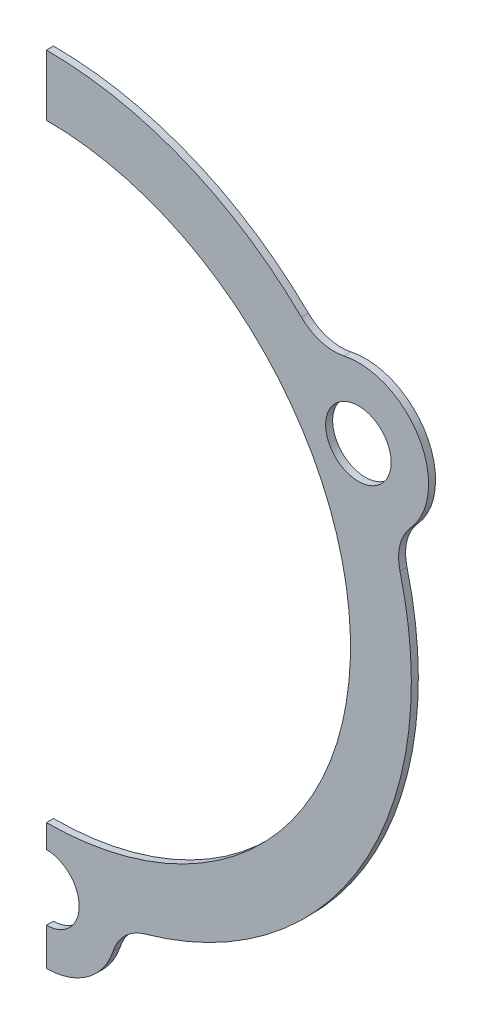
ISO-10303-21;
HEADER;
FILE_DESCRIPTION(('STEP AP214'),'2;1');
FILE_NAME('part.step','',(''),(''),'','','');
FILE_SCHEMA(('AUTOMOTIVE_DESIGN { 1 0 10303 214 1 1 1 1 }'));
ENDSEC;
DATA;
#1=APPLICATION_CONTEXT('core data for automotive mechanical design processes');
#2=APPLICATION_PROTOCOL_DEFINITION('international standard','automotive_design',2000,#1);
#3=PRODUCT_CONTEXT('',#1,'mechanical');
#4=PRODUCT('Part','Part','',(#3));
#5=PRODUCT_RELATED_PRODUCT_CATEGORY('part','',(#4));
#6=PRODUCT_DEFINITION_FORMATION('','',#4);
#7=PRODUCT_DEFINITION_CONTEXT('part definition',#1,'design');
#8=PRODUCT_DEFINITION('design','',#6,#7);
#9=PRODUCT_DEFINITION_SHAPE('','',#8);
#10=(LENGTH_UNIT() NAMED_UNIT(*) SI_UNIT(.MILLI.,.METRE.));
#11=(NAMED_UNIT(*) PLANE_ANGLE_UNIT() SI_UNIT($,.RADIAN.));
#12=(NAMED_UNIT(*) SI_UNIT($,.STERADIAN.) SOLID_ANGLE_UNIT());
#13=UNCERTAINTY_MEASURE_WITH_UNIT(LENGTH_MEASURE(1.E-05),#10,'distance_accuracy_value','');
#14=(GEOMETRIC_REPRESENTATION_CONTEXT(3) GLOBAL_UNCERTAINTY_ASSIGNED_CONTEXT((#13)) GLOBAL_UNIT_ASSIGNED_CONTEXT((#10,
#11,#12)) REPRESENTATION_CONTEXT('',''));
#15=CARTESIAN_POINT('',(0.,0.,0.));
#16=DIRECTION('',(0.,0.,1.));
#17=DIRECTION('',(1.,0.,0.));
#18=AXIS2_PLACEMENT_3D('',#15,#16,#17);
#19=CARTESIAN_POINT('',(11.8879062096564,-80.8636363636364,1.5));
#20=DIRECTION('',(0.,0.,1.));
#21=DIRECTION('',(1.,0.,0.));
#22=AXIS2_PLACEMENT_3D('',#19,#20,#21);
#23=PLANE('',#22);
#24=DIRECTION('',(0.,1.,0.));
#25=VECTOR('',#24,1.);
#26=CARTESIAN_POINT('',(0.,80.,1.5));
#27=LINE('',#26,#25);
#28=CARTESIAN_POINT('',(0.,-92.,1.5));
#29=VERTEX_POINT('',#28);
#30=CARTESIAN_POINT('',(0.,-84.,1.5));
#31=VERTEX_POINT('',#30);
#32=EDGE_CURVE('E47',#29,#31,#27,.T.);
#33=ORIENTED_EDGE('',*,*,#32,.F.);
#34=CARTESIAN_POINT('',(0.,-77.,1.5));
#35=DIRECTION('',(0.,0.,1.));
#36=DIRECTION('',(1.,0.,0.));
#37=AXIS2_PLACEMENT_3D('',#34,#35,#36);
#38=CIRCLE('',#37,15.);
#39=CARTESIAN_POINT('',(14.2654874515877,-81.6363636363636,1.5));
#40=VERTEX_POINT('',#39);
#41=EDGE_CURVE('E125',#29,#40,#38,.T.);
#42=ORIENTED_EDGE('',*,*,#41,.T.);
#43=CARTESIAN_POINT('',(23.7758124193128,-84.7272727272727,1.5));
#44=DIRECTION('',(0.,0.,-1.));
#45=DIRECTION('',(1.,0.,0.));
#46=AXIS2_PLACEMENT_3D('',#43,#44,#45);
#47=CIRCLE('',#46,10.);
#48=CARTESIAN_POINT('',(21.0740155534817,-75.099173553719,1.5));
#49=VERTEX_POINT('',#48);
#50=EDGE_CURVE('E187',#40,#49,#47,.T.);
#51=ORIENTED_EDGE('',*,*,#50,.T.);
#52=CARTESIAN_POINT('',(0.,0.,1.5));
#53=DIRECTION('',(0.,0.,1.));
#54=DIRECTION('',(1.,0.,0.));
#55=AXIS2_PLACEMENT_3D('',#52,#53,#54);
#56=CIRCLE('',#55,78.);
#57=CARTESIAN_POINT('',(75.5747998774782,19.2989539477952,1.5));
#58=VERTEX_POINT('',#57);
#59=EDGE_CURVE('E194',#49,#58,#56,.T.);
#60=ORIENTED_EDGE('',*,*,#59,.T.);
#61=CARTESIAN_POINT('',(85.2638767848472,21.7731788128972,1.5));
#62=DIRECTION('',(0.,0.,-1.));
#63=DIRECTION('',(-1.,0.,0.));
#64=AXIS2_PLACEMENT_3D('',#61,#62,#63);
#65=CIRCLE('',#64,10.);
#66=CARTESIAN_POINT('',(77.8319085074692,28.463907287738,1.5));
#67=VERTEX_POINT('',#66);
#68=EDGE_CURVE('E196',#58,#67,#65,.T.);
#69=ORIENTED_EDGE('',*,*,#68,.T.);
#70=CARTESIAN_POINT('',(66.6839560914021,38.4999999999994,1.5));
#71=DIRECTION('',(0.,0.,1.));
#72=DIRECTION('',(1.,0.,0.));
#73=AXIS2_PLACEMENT_3D('',#70,#71,#72);
#74=CIRCLE('',#73,15.);
#75=CARTESIAN_POINT('',(63.5664210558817,53.1724563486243,1.5));
#76=VERTEX_POINT('',#75);
#77=EDGE_CURVE('E198',#67,#76,#74,.T.);
#78=ORIENTED_EDGE('',*,*,#77,.T.);
#79=CARTESIAN_POINT('',(61.4880643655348,62.9540939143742,1.5));
#80=DIRECTION('',(0.,0.,-1.));
#81=DIRECTION('',(1.,0.,0.));
#82=AXIS2_PLACEMENT_3D('',#79,#80,#81);
#83=CIRCLE('',#82,10.);
#84=CARTESIAN_POINT('',(54.5007843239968,55.8002196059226,1.5));
#85=VERTEX_POINT('',#84);
#86=EDGE_CURVE('E142',#76,#85,#83,.T.);
#87=ORIENTED_EDGE('',*,*,#86,.T.);
#88=CARTESIAN_POINT('',(0.,0.,1.5));
#89=DIRECTION('',(0.,0.,1.));
#90=DIRECTION('',(1.,0.,0.));
#91=AXIS2_PLACEMENT_3D('',#88,#89,#90);
#92=CIRCLE('',#91,78.);
#93=CARTESIAN_POINT('',(0.,78.,1.5));
#94=VERTEX_POINT('',#93);
#95=EDGE_CURVE('E137',#85,#94,#92,.T.);
#96=ORIENTED_EDGE('',*,*,#95,.T.);
#97=CARTESIAN_POINT('',(0.,65.,1.5));
#98=VERTEX_POINT('',#97);
#99=EDGE_CURVE('E132',#98,#94,#27,.T.);
#100=ORIENTED_EDGE('',*,*,#99,.F.);
#101=CARTESIAN_POINT('',(0.,0.,1.5));
#102=DIRECTION('',(0.,0.,1.));
#103=DIRECTION('',(1.,0.,0.));
#104=AXIS2_PLACEMENT_3D('',#101,#102,#103);
#105=CIRCLE('',#104,65.);
#106=CARTESIAN_POINT('',(0.,-65.,1.5));
#107=VERTEX_POINT('',#106);
#108=EDGE_CURVE('E216',#107,#98,#105,.T.);
#109=ORIENTED_EDGE('',*,*,#108,.F.);
#110=CARTESIAN_POINT('',(0.,-70.,1.5));
#111=VERTEX_POINT('',#110);
#112=EDGE_CURVE('E130',#111,#107,#27,.T.);
#113=ORIENTED_EDGE('',*,*,#112,.F.);
#114=CARTESIAN_POINT('',(0.,-77.,1.5));
#115=DIRECTION('',(0.,0.,1.));
#116=DIRECTION('',(1.,0.,0.));
#117=AXIS2_PLACEMENT_3D('',#114,#115,#116);
#118=CIRCLE('',#117,7.);
#119=EDGE_CURVE('E129',#31,#111,#118,.T.);
#120=ORIENTED_EDGE('',*,*,#119,.F.);
#121=EDGE_LOOP('',(#33,#42,#51,#60,#69,#78,#87,#96,#100,#109,#113,#120));
#122=FACE_BOUND('',#121,.T.);
#123=CARTESIAN_POINT('',(66.6839560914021,38.4999999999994,1.5));
#124=DIRECTION('',(0.,0.,1.));
#125=DIRECTION('',(-0.499999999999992,0.866025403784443,0.));
#126=AXIS2_PLACEMENT_3D('',#123,#124,#125);
#127=CIRCLE('',#126,7.);
#128=CARTESIAN_POINT('',(63.1839560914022,44.5621778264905,1.5));
#129=VERTEX_POINT('',#128);
#130=EDGE_CURVE('E225',#129,#129,#127,.T.);
#131=ORIENTED_EDGE('',*,*,#130,.F.);
#132=EDGE_LOOP('',(#131));
#133=FACE_BOUND('',#132,.T.);
#134=ADVANCED_FACE('F24',(#122,#133),#23,.T.);
#135=CARTESIAN_POINT('',(11.8879062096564,-80.8636363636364,0.));
#136=DIRECTION('',(0.,0.,1.));
#137=DIRECTION('',(1.,0.,0.));
#138=AXIS2_PLACEMENT_3D('',#135,#136,#137);
#139=PLANE('',#138);
#140=CARTESIAN_POINT('',(66.6839560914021,38.4999999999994,0.));
#141=DIRECTION('',(0.,0.,1.));
#142=DIRECTION('',(-0.499999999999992,0.866025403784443,0.));
#143=AXIS2_PLACEMENT_3D('',#140,#141,#142);
#144=CIRCLE('',#143,7.);
#145=CARTESIAN_POINT('',(63.1839560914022,44.5621778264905,0.));
#146=VERTEX_POINT('',#145);
#147=EDGE_CURVE('E222',#146,#146,#144,.T.);
#148=ORIENTED_EDGE('',*,*,#147,.T.);
#149=EDGE_LOOP('',(#148));
#150=FACE_BOUND('',#149,.T.);
#151=CARTESIAN_POINT('',(0.,-77.,0.));
#152=DIRECTION('',(0.,0.,1.));
#153=DIRECTION('',(1.,0.,0.));
#154=AXIS2_PLACEMENT_3D('',#151,#152,#153);
#155=CIRCLE('',#154,15.);
#156=CARTESIAN_POINT('',(0.,-92.,0.));
#157=VERTEX_POINT('',#156);
#158=CARTESIAN_POINT('',(14.2654874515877,-81.6363636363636,0.));
#159=VERTEX_POINT('',#158);
#160=EDGE_CURVE('E168',#157,#159,#155,.T.);
#161=ORIENTED_EDGE('',*,*,#160,.F.);
#162=DIRECTION('',(0.,1.,0.));
#163=VECTOR('',#162,1.);
#164=CARTESIAN_POINT('',(0.,80.,0.));
#165=LINE('',#164,#163);
#166=CARTESIAN_POINT('',(0.,-84.,0.));
#167=VERTEX_POINT('',#166);
#168=EDGE_CURVE('E114',#157,#167,#165,.T.);
#169=ORIENTED_EDGE('',*,*,#168,.T.);
#170=CARTESIAN_POINT('',(0.,-77.,0.));
#171=DIRECTION('',(0.,0.,1.));
#172=DIRECTION('',(1.,0.,0.));
#173=AXIS2_PLACEMENT_3D('',#170,#171,#172);
#174=CIRCLE('',#173,7.);
#175=CARTESIAN_POINT('',(0.,-70.,0.));
#176=VERTEX_POINT('',#175);
#177=EDGE_CURVE('E163',#167,#176,#174,.T.);
#178=ORIENTED_EDGE('',*,*,#177,.T.);
#179=CARTESIAN_POINT('',(0.,-65.,0.));
#180=VERTEX_POINT('',#179);
#181=EDGE_CURVE('E170',#176,#180,#165,.T.);
#182=ORIENTED_EDGE('',*,*,#181,.T.);
#183=CARTESIAN_POINT('',(0.,0.,0.));
#184=DIRECTION('',(0.,0.,1.));
#185=DIRECTION('',(1.,0.,0.));
#186=AXIS2_PLACEMENT_3D('',#183,#184,#185);
#187=CIRCLE('',#186,65.);
#188=CARTESIAN_POINT('',(0.,65.,0.));
#189=VERTEX_POINT('',#188);
#190=EDGE_CURVE('E179',#180,#189,#187,.T.);
#191=ORIENTED_EDGE('',*,*,#190,.T.);
#192=CARTESIAN_POINT('',(0.,78.,0.));
#193=VERTEX_POINT('',#192);
#194=EDGE_CURVE('E39',#189,#193,#165,.T.);
#195=ORIENTED_EDGE('',*,*,#194,.T.);
#196=CARTESIAN_POINT('',(0.,0.,0.));
#197=DIRECTION('',(0.,0.,1.));
#198=DIRECTION('',(1.,0.,0.));
#199=AXIS2_PLACEMENT_3D('',#196,#197,#198);
#200=CIRCLE('',#199,78.);
#201=CARTESIAN_POINT('',(54.5007843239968,55.8002196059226,0.));
#202=VERTEX_POINT('',#201);
#203=EDGE_CURVE('E177',#202,#193,#200,.T.);
#204=ORIENTED_EDGE('',*,*,#203,.F.);
#205=CARTESIAN_POINT('',(61.4880643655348,62.9540939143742,0.));
#206=DIRECTION('',(0.,0.,-1.));
#207=DIRECTION('',(1.,0.,0.));
#208=AXIS2_PLACEMENT_3D('',#205,#206,#207);
#209=CIRCLE('',#208,10.);
#210=CARTESIAN_POINT('',(63.5664210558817,53.1724563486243,0.));
#211=VERTEX_POINT('',#210);
#212=EDGE_CURVE('E185',#211,#202,#209,.T.);
#213=ORIENTED_EDGE('',*,*,#212,.F.);
#214=CARTESIAN_POINT('',(66.6839560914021,38.4999999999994,0.));
#215=DIRECTION('',(0.,0.,1.));
#216=DIRECTION('',(1.,0.,0.));
#217=AXIS2_PLACEMENT_3D('',#214,#215,#216);
#218=CIRCLE('',#217,15.);
#219=CARTESIAN_POINT('',(77.8319085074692,28.463907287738,0.));
#220=VERTEX_POINT('',#219);
#221=EDGE_CURVE('E189',#220,#211,#218,.T.);
#222=ORIENTED_EDGE('',*,*,#221,.F.);
#223=CARTESIAN_POINT('',(85.2638767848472,21.7731788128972,0.));
#224=DIRECTION('',(0.,0.,-1.));
#225=DIRECTION('',(-1.,0.,0.));
#226=AXIS2_PLACEMENT_3D('',#223,#224,#225);
#227=CIRCLE('',#226,10.);
#228=CARTESIAN_POINT('',(75.5747998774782,19.2989539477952,0.));
#229=VERTEX_POINT('',#228);
#230=EDGE_CURVE('E207',#229,#220,#227,.T.);
#231=ORIENTED_EDGE('',*,*,#230,.F.);
#232=CARTESIAN_POINT('',(0.,0.,0.));
#233=DIRECTION('',(0.,0.,1.));
#234=DIRECTION('',(1.,0.,0.));
#235=AXIS2_PLACEMENT_3D('',#232,#233,#234);
#236=CIRCLE('',#235,78.);
#237=CARTESIAN_POINT('',(21.0740155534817,-75.099173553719,0.));
#238=VERTEX_POINT('',#237);
#239=EDGE_CURVE('E209',#238,#229,#236,.T.);
#240=ORIENTED_EDGE('',*,*,#239,.F.);
#241=CARTESIAN_POINT('',(23.7758124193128,-84.7272727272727,0.));
#242=DIRECTION('',(0.,0.,-1.));
#243=DIRECTION('',(1.,0.,0.));
#244=AXIS2_PLACEMENT_3D('',#241,#242,#243);
#245=CIRCLE('',#244,10.);
#246=EDGE_CURVE('E213',#159,#238,#245,.T.);
#247=ORIENTED_EDGE('',*,*,#246,.F.);
#248=EDGE_LOOP('',(#161,#169,#178,#182,#191,#195,#204,#213,#222,#231,#240,#247));
#249=FACE_BOUND('',#248,.T.);
#250=ADVANCED_FACE('F165',(#150,#249),#139,.F.);
#251=CARTESIAN_POINT('',(23.7758124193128,-84.7272727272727,1.5));
#252=DIRECTION('',(0.,0.,-1.));
#253=DIRECTION('',(-1.,0.,0.));
#254=AXIS2_PLACEMENT_3D('',#251,#252,#253);
#255=CYLINDRICAL_SURFACE('',#254,10.);
#256=ORIENTED_EDGE('',*,*,#246,.T.);
#257=DIRECTION('',(0.,0.,-1.));
#258=VECTOR('',#257,1.);
#259=CARTESIAN_POINT('',(21.0740155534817,-75.099173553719,1.5));
#260=LINE('',#259,#258);
#261=EDGE_CURVE('E157',#49,#238,#260,.T.);
#262=ORIENTED_EDGE('',*,*,#261,.F.);
#263=ORIENTED_EDGE('',*,*,#50,.F.);
#264=DIRECTION('',(0.,0.,-1.));
#265=VECTOR('',#264,1.);
#266=CARTESIAN_POINT('',(14.2654874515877,-81.6363636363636,1.5));
#267=LINE('',#266,#265);
#268=EDGE_CURVE('E135',#40,#159,#267,.T.);
#269=ORIENTED_EDGE('',*,*,#268,.T.);
#270=EDGE_LOOP('',(#256,#262,#263,#269));
#271=FACE_BOUND('',#270,.T.);
#272=ADVANCED_FACE('F26',(#271),#255,.F.);
#273=CARTESIAN_POINT('',(0.,0.,1.5));
#274=DIRECTION('',(0.,0.,-1.));
#275=DIRECTION('',(-1.,0.,0.));
#276=AXIS2_PLACEMENT_3D('',#273,#274,#275);
#277=CYLINDRICAL_SURFACE('',#276,78.);
#278=ORIENTED_EDGE('',*,*,#239,.T.);
#279=DIRECTION('',(0.,0.,-1.));
#280=VECTOR('',#279,1.);
#281=CARTESIAN_POINT('',(75.5747998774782,19.2989539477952,1.5));
#282=LINE('',#281,#280);
#283=EDGE_CURVE('E154',#58,#229,#282,.T.);
#284=ORIENTED_EDGE('',*,*,#283,.F.);
#285=ORIENTED_EDGE('',*,*,#59,.F.);
#286=ORIENTED_EDGE('',*,*,#261,.T.);
#287=EDGE_LOOP('',(#278,#284,#285,#286));
#288=FACE_BOUND('',#287,.T.);
#289=ADVANCED_FACE('F264',(#288),#277,.T.);
#290=CARTESIAN_POINT('',(85.2638767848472,21.7731788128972,1.5));
#291=DIRECTION('',(0.,0.,-1.));
#292=DIRECTION('',(-1.,0.,0.));
#293=AXIS2_PLACEMENT_3D('',#290,#291,#292);
#294=CYLINDRICAL_SURFACE('',#293,10.);
#295=ORIENTED_EDGE('',*,*,#230,.T.);
#296=DIRECTION('',(0.,0.,-1.));
#297=VECTOR('',#296,1.);
#298=CARTESIAN_POINT('',(77.8319085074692,28.463907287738,1.5));
#299=LINE('',#298,#297);
#300=EDGE_CURVE('E151',#67,#220,#299,.T.);
#301=ORIENTED_EDGE('',*,*,#300,.F.);
#302=ORIENTED_EDGE('',*,*,#68,.F.);
#303=ORIENTED_EDGE('',*,*,#283,.T.);
#304=EDGE_LOOP('',(#295,#301,#302,#303));
#305=FACE_BOUND('',#304,.T.);
#306=ADVANCED_FACE('F262',(#305),#294,.F.);
#307=CARTESIAN_POINT('',(66.6839560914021,38.4999999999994,1.5));
#308=DIRECTION('',(0.,0.,-1.));
#309=DIRECTION('',(-1.,0.,0.));
#310=AXIS2_PLACEMENT_3D('',#307,#308,#309);
#311=CYLINDRICAL_SURFACE('',#310,15.);
#312=ORIENTED_EDGE('',*,*,#221,.T.);
#313=DIRECTION('',(0.,0.,-1.));
#314=VECTOR('',#313,1.);
#315=CARTESIAN_POINT('',(63.5664210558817,53.1724563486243,1.5));
#316=LINE('',#315,#314);
#317=EDGE_CURVE('E148',#76,#211,#316,.T.);
#318=ORIENTED_EDGE('',*,*,#317,.F.);
#319=ORIENTED_EDGE('',*,*,#77,.F.);
#320=ORIENTED_EDGE('',*,*,#300,.T.);
#321=EDGE_LOOP('',(#312,#318,#319,#320));
#322=FACE_BOUND('',#321,.T.);
#323=ADVANCED_FACE('F259',(#322),#311,.T.);
#324=CARTESIAN_POINT('',(61.4880643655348,62.9540939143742,1.5));
#325=DIRECTION('',(0.,0.,-1.));
#326=DIRECTION('',(-1.,0.,0.));
#327=AXIS2_PLACEMENT_3D('',#324,#325,#326);
#328=CYLINDRICAL_SURFACE('',#327,10.);
#329=ORIENTED_EDGE('',*,*,#212,.T.);
#330=DIRECTION('',(0.,0.,-1.));
#331=VECTOR('',#330,1.);
#332=CARTESIAN_POINT('',(54.5007843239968,55.8002196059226,1.5));
#333=LINE('',#332,#331);
#334=EDGE_CURVE('E139',#85,#202,#333,.T.);
#335=ORIENTED_EDGE('',*,*,#334,.F.);
#336=ORIENTED_EDGE('',*,*,#86,.F.);
#337=ORIENTED_EDGE('',*,*,#317,.T.);
#338=EDGE_LOOP('',(#329,#335,#336,#337));
#339=FACE_BOUND('',#338,.T.);
#340=ADVANCED_FACE('F204',(#339),#328,.F.);
#341=CARTESIAN_POINT('',(0.,0.,1.5));
#342=DIRECTION('',(0.,0.,-1.));
#343=DIRECTION('',(-1.,0.,0.));
#344=AXIS2_PLACEMENT_3D('',#341,#342,#343);
#345=CYLINDRICAL_SURFACE('',#344,78.);
#346=ORIENTED_EDGE('',*,*,#203,.T.);
#347=DIRECTION('',(0.,0.,-1.));
#348=VECTOR('',#347,1.);
#349=CARTESIAN_POINT('',(0.,78.,1.5));
#350=LINE('',#349,#348);
#351=EDGE_CURVE('E118',#193,#94,#350,.F.);
#352=ORIENTED_EDGE('',*,*,#351,.T.);
#353=ORIENTED_EDGE('',*,*,#95,.F.);
#354=ORIENTED_EDGE('',*,*,#334,.T.);
#355=EDGE_LOOP('',(#346,#352,#353,#354));
#356=FACE_BOUND('',#355,.T.);
#357=ADVANCED_FACE('F182',(#356),#345,.T.);
#358=CARTESIAN_POINT('',(0.,-77.,1.5));
#359=DIRECTION('',(0.,0.,-1.));
#360=DIRECTION('',(-1.,0.,0.));
#361=AXIS2_PLACEMENT_3D('',#358,#359,#360);
#362=CYLINDRICAL_SURFACE('',#361,15.);
#363=ORIENTED_EDGE('',*,*,#41,.F.);
#364=DIRECTION('',(0.,0.,-1.));
#365=VECTOR('',#364,1.);
#366=CARTESIAN_POINT('',(0.,-92.,1.5));
#367=LINE('',#366,#365);
#368=EDGE_CURVE('E111',#29,#157,#367,.T.);
#369=ORIENTED_EDGE('',*,*,#368,.T.);
#370=ORIENTED_EDGE('',*,*,#160,.T.);
#371=ORIENTED_EDGE('',*,*,#268,.F.);
#372=EDGE_LOOP('',(#363,#369,#370,#371));
#373=FACE_BOUND('',#372,.T.);
#374=ADVANCED_FACE('F133',(#373),#362,.T.);
#375=CARTESIAN_POINT('',(0.,0.,1.5));
#376=DIRECTION('',(0.,0.,-1.));
#377=DIRECTION('',(-1.,0.,0.));
#378=AXIS2_PLACEMENT_3D('',#375,#376,#377);
#379=CYLINDRICAL_SURFACE('',#378,65.);
#380=DIRECTION('',(0.,0.,-1.));
#381=VECTOR('',#380,1.);
#382=CARTESIAN_POINT('',(0.,-65.,1.5));
#383=LINE('',#382,#381);
#384=EDGE_CURVE('E119',#107,#180,#383,.T.);
#385=ORIENTED_EDGE('',*,*,#384,.F.);
#386=ORIENTED_EDGE('',*,*,#108,.T.);
#387=DIRECTION('',(0.,0.,-1.));
#388=VECTOR('',#387,1.);
#389=CARTESIAN_POINT('',(0.,65.,1.5));
#390=LINE('',#389,#388);
#391=EDGE_CURVE('E169',#189,#98,#390,.F.);
#392=ORIENTED_EDGE('',*,*,#391,.F.);
#393=ORIENTED_EDGE('',*,*,#190,.F.);
#394=EDGE_LOOP('',(#385,#386,#392,#393));
#395=FACE_BOUND('',#394,.T.);
#396=ADVANCED_FACE('F234',(#395),#379,.F.);
#397=CARTESIAN_POINT('',(0.,-77.,0.));
#398=DIRECTION('',(0.,0.,1.));
#399=DIRECTION('',(1.,0.,0.));
#400=AXIS2_PLACEMENT_3D('',#397,#398,#399);
#401=CYLINDRICAL_SURFACE('',#400,7.);
#402=ORIENTED_EDGE('',*,*,#119,.T.);
#403=DIRECTION('',(0.,0.,1.));
#404=VECTOR('',#403,1.);
#405=CARTESIAN_POINT('',(0.,-70.,0.));
#406=LINE('',#405,#404);
#407=EDGE_CURVE('E11',#111,#176,#406,.F.);
#408=ORIENTED_EDGE('',*,*,#407,.T.);
#409=ORIENTED_EDGE('',*,*,#177,.F.);
#410=DIRECTION('',(0.,0.,1.));
#411=VECTOR('',#410,1.);
#412=CARTESIAN_POINT('',(0.,-84.,0.));
#413=LINE('',#412,#411);
#414=EDGE_CURVE('E32',#167,#31,#413,.T.);
#415=ORIENTED_EDGE('',*,*,#414,.T.);
#416=EDGE_LOOP('',(#402,#408,#409,#415));
#417=FACE_BOUND('',#416,.T.);
#418=ADVANCED_FACE('F161',(#417),#401,.F.);
#419=CARTESIAN_POINT('',(66.6839560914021,38.4999999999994,0.));
#420=DIRECTION('',(0.,0.,1.));
#421=DIRECTION('',(1.,0.,0.));
#422=AXIS2_PLACEMENT_3D('',#419,#420,#421);
#423=CYLINDRICAL_SURFACE('',#422,7.);
#424=ORIENTED_EDGE('',*,*,#147,.F.);
#425=EDGE_LOOP('',(#424));
#426=FACE_BOUND('',#425,.T.);
#427=ORIENTED_EDGE('',*,*,#130,.T.);
#428=EDGE_LOOP('',(#427));
#429=FACE_BOUND('',#428,.T.);
#430=ADVANCED_FACE('F243',(#426,#429),#423,.F.);
#431=CARTESIAN_POINT('',(0.,80.,0.));
#432=DIRECTION('',(1.,0.,0.));
#433=DIRECTION('',(0.,0.,-1.));
#434=AXIS2_PLACEMENT_3D('',#431,#432,#433);
#435=PLANE('',#434);
#436=ORIENTED_EDGE('',*,*,#32,.T.);
#437=ORIENTED_EDGE('',*,*,#414,.F.);
#438=ORIENTED_EDGE('',*,*,#168,.F.);
#439=ORIENTED_EDGE('',*,*,#368,.F.);
#440=EDGE_LOOP('',(#436,#437,#438,#439));
#441=FACE_BOUND('',#440,.T.);
#442=ADVANCED_FACE('F112',(#441),#435,.F.);
#443=ORIENTED_EDGE('',*,*,#384,.T.);
#444=ORIENTED_EDGE('',*,*,#181,.F.);
#445=ORIENTED_EDGE('',*,*,#407,.F.);
#446=ORIENTED_EDGE('',*,*,#112,.T.);
#447=EDGE_LOOP('',(#443,#444,#445,#446));
#448=FACE_BOUND('',#447,.T.);
#449=ADVANCED_FACE('F231',(#448),#435,.F.);
#450=ORIENTED_EDGE('',*,*,#194,.F.);
#451=ORIENTED_EDGE('',*,*,#391,.T.);
#452=ORIENTED_EDGE('',*,*,#99,.T.);
#453=ORIENTED_EDGE('',*,*,#351,.F.);
#454=EDGE_LOOP('',(#450,#451,#452,#453));
#455=FACE_BOUND('',#454,.T.);
#456=ADVANCED_FACE('F235',(#455),#435,.F.);
#457=CLOSED_SHELL('',(#134,#250,#272,#289,#306,#323,#340,#357,#374,#396,#418,#430,#442,#449,#456));
#458=MANIFOLD_SOLID_BREP('B2',#457);
#459=ADVANCED_BREP_SHAPE_REPRESENTATION('',(#18,#458),#14);
#460=SHAPE_DEFINITION_REPRESENTATION(#9,#459);
ENDSEC;
END-ISO-10303-21;
